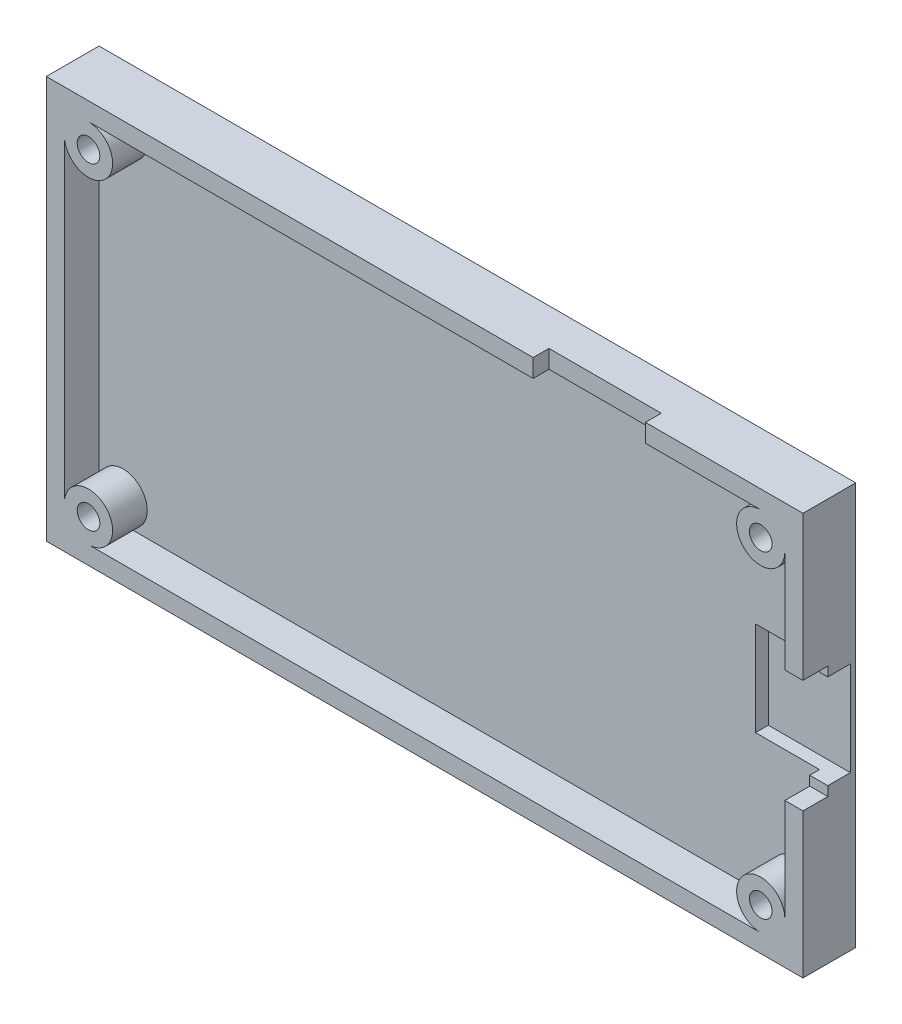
ISO-10303-21;
HEADER;
FILE_DESCRIPTION(('STEP AP214'),'2;1');
FILE_NAME('part.step','',(''),(''),'','','');
FILE_SCHEMA(('AUTOMOTIVE_DESIGN { 1 0 10303 214 1 1 1 1 }'));
ENDSEC;
DATA;
#1=APPLICATION_CONTEXT('core data for automotive mechanical design processes');
#2=APPLICATION_PROTOCOL_DEFINITION('international standard','automotive_design',2000,#1);
#3=PRODUCT_CONTEXT('',#1,'mechanical');
#4=PRODUCT('Part','Part','',(#3));
#5=PRODUCT_RELATED_PRODUCT_CATEGORY('part','',(#4));
#6=PRODUCT_DEFINITION_FORMATION('','',#4);
#7=PRODUCT_DEFINITION_CONTEXT('part definition',#1,'design');
#8=PRODUCT_DEFINITION('design','',#6,#7);
#9=PRODUCT_DEFINITION_SHAPE('','',#8);
#10=(LENGTH_UNIT() NAMED_UNIT(*) SI_UNIT(.MILLI.,.METRE.));
#11=(NAMED_UNIT(*) PLANE_ANGLE_UNIT() SI_UNIT($,.RADIAN.));
#12=(NAMED_UNIT(*) SI_UNIT($,.STERADIAN.) SOLID_ANGLE_UNIT());
#13=UNCERTAINTY_MEASURE_WITH_UNIT(LENGTH_MEASURE(1.E-05),#10,'distance_accuracy_value','');
#14=(GEOMETRIC_REPRESENTATION_CONTEXT(3) GLOBAL_UNCERTAINTY_ASSIGNED_CONTEXT((#13)) GLOBAL_UNIT_ASSIGNED_CONTEXT((#10,
#11,#12)) REPRESENTATION_CONTEXT('',''));
#15=CARTESIAN_POINT('',(0.,0.,0.));
#16=DIRECTION('',(0.,0.,1.));
#17=DIRECTION('',(1.,0.,0.));
#18=AXIS2_PLACEMENT_3D('',#15,#16,#17);
#19=CARTESIAN_POINT('',(0.,0.,7.));
#20=DIRECTION('',(0.,0.,-1.));
#21=DIRECTION('',(-1.,0.,0.));
#22=AXIS2_PLACEMENT_3D('',#19,#20,#21);
#23=PLANE('',#22);
#24=CARTESIAN_POINT('',(44.6,21.1,7.));
#25=DIRECTION('',(0.,0.,-1.));
#26=DIRECTION('',(-1.,0.,0.));
#27=AXIS2_PLACEMENT_3D('',#24,#25,#26);
#28=CIRCLE('',#27,1.5);
#29=CARTESIAN_POINT('',(43.1,21.1,7.));
#30=VERTEX_POINT('',#29);
#31=EDGE_CURVE('E434',#30,#30,#28,.T.);
#32=ORIENTED_EDGE('',*,*,#31,.T.);
#33=EDGE_LOOP('',(#32));
#34=FACE_BOUND('',#33,.T.);
#35=DIRECTION('',(-1.,0.,0.));
#36=VECTOR('',#35,1.);
#37=CARTESIAN_POINT('',(50.2,26.7,7.));
#38=LINE('',#37,#36);
#39=CARTESIAN_POINT('',(50.2,26.7,7.));
#40=VERTEX_POINT('',#39);
#41=CARTESIAN_POINT('',(29.3,26.7,7.));
#42=VERTEX_POINT('',#41);
#43=EDGE_CURVE('E227',#40,#42,#38,.T.);
#44=ORIENTED_EDGE('',*,*,#43,.T.);
#45=DIRECTION('',(0.,1.,0.));
#46=VECTOR('',#45,1.);
#47=CARTESIAN_POINT('',(29.3,28.7627397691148,7.));
#48=LINE('',#47,#46);
#49=CARTESIAN_POINT('',(29.3,24.3,7.));
#50=VERTEX_POINT('',#49);
#51=EDGE_CURVE('E214',#50,#42,#48,.T.);
#52=ORIENTED_EDGE('',*,*,#51,.F.);
#53=DIRECTION('',(-1.,0.,0.));
#54=VECTOR('',#53,1.);
#55=CARTESIAN_POINT('',(47.8,24.3,7.));
#56=LINE('',#55,#54);
#57=CARTESIAN_POINT('',(44.6,24.3,7.));
#58=VERTEX_POINT('',#57);
#59=EDGE_CURVE('E224',#58,#50,#56,.T.);
#60=ORIENTED_EDGE('',*,*,#59,.F.);
#61=CARTESIAN_POINT('',(44.6,21.1,7.));
#62=DIRECTION('',(0.,0.,-1.));
#63=DIRECTION('',(-1.,0.,0.));
#64=AXIS2_PLACEMENT_3D('',#61,#62,#63);
#65=CIRCLE('',#64,3.20000000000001);
#66=CARTESIAN_POINT('',(47.8,21.1,7.));
#67=VERTEX_POINT('',#66);
#68=EDGE_CURVE('E428',#67,#58,#65,.T.);
#69=ORIENTED_EDGE('',*,*,#68,.F.);
#70=DIRECTION('',(0.,1.,0.));
#71=VECTOR('',#70,1.);
#72=CARTESIAN_POINT('',(47.8,24.3,7.));
#73=LINE('',#72,#71);
#74=CARTESIAN_POINT('',(47.8,7.5,7.));
#75=VERTEX_POINT('',#74);
#76=EDGE_CURVE('E441',#75,#67,#73,.T.);
#77=ORIENTED_EDGE('',*,*,#76,.F.);
#78=DIRECTION('',(-1.,0.,0.));
#79=VECTOR('',#78,1.);
#80=CARTESIAN_POINT('',(51.4105747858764,7.50000000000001,7.));
#81=LINE('',#80,#79);
#82=CARTESIAN_POINT('',(50.2,7.50000000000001,7.));
#83=VERTEX_POINT('',#82);
#84=EDGE_CURVE('E373',#83,#75,#81,.T.);
#85=ORIENTED_EDGE('',*,*,#84,.F.);
#86=DIRECTION('',(0.,1.,0.));
#87=VECTOR('',#86,1.);
#88=CARTESIAN_POINT('',(50.2,26.7,7.));
#89=LINE('',#88,#87);
#90=EDGE_CURVE('E251',#83,#40,#89,.T.);
#91=ORIENTED_EDGE('',*,*,#90,.T.);
#92=EDGE_LOOP('',(#44,#52,#60,#69,#77,#85,#91));
#93=FACE_BOUND('',#92,.T.);
#94=ADVANCED_FACE('F39',(#34,#93),#23,.F.);
#95=CARTESIAN_POINT('',(47.8,24.3,7.));
#96=DIRECTION('',(-1.,0.,0.));
#97=DIRECTION('',(0.,-1.,0.));
#98=AXIS2_PLACEMENT_3D('',#95,#96,#97);
#99=PLANE('',#98);
#100=DIRECTION('',(0.,-1.,0.));
#101=VECTOR('',#100,1.);
#102=CARTESIAN_POINT('',(47.8,24.3,3.7));
#103=LINE('',#102,#101);
#104=CARTESIAN_POINT('',(47.8,-6.25,3.7));
#105=VERTEX_POINT('',#104);
#106=CARTESIAN_POINT('',(47.8,-7.5,3.7));
#107=VERTEX_POINT('',#106);
#108=EDGE_CURVE('E376',#105,#107,#103,.T.);
#109=ORIENTED_EDGE('',*,*,#108,.F.);
#110=DIRECTION('',(0.,0.,-1.));
#111=VECTOR('',#110,1.);
#112=CARTESIAN_POINT('',(47.8,-6.25,7.));
#113=LINE('',#112,#111);
#114=CARTESIAN_POINT('',(47.8,-6.25,2.4));
#115=VERTEX_POINT('',#114);
#116=EDGE_CURVE('E62',#105,#115,#113,.T.);
#117=ORIENTED_EDGE('',*,*,#116,.T.);
#118=DIRECTION('',(0.,-1.,0.));
#119=VECTOR('',#118,1.);
#120=CARTESIAN_POINT('',(47.8,24.3,2.4));
#121=LINE('',#120,#119);
#122=CARTESIAN_POINT('',(47.8,-21.1,2.4));
#123=VERTEX_POINT('',#122);
#124=EDGE_CURVE('E282',#115,#123,#121,.T.);
#125=ORIENTED_EDGE('',*,*,#124,.T.);
#126=DIRECTION('',(0.,0.,-1.));
#127=VECTOR('',#126,1.);
#128=CARTESIAN_POINT('',(47.8,-21.1,16.0509667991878));
#129=LINE('',#128,#127);
#130=CARTESIAN_POINT('',(47.8,-21.1,7.));
#131=VERTEX_POINT('',#130);
#132=EDGE_CURVE('E405',#131,#123,#129,.T.);
#133=ORIENTED_EDGE('',*,*,#132,.F.);
#134=CARTESIAN_POINT('',(47.8,-7.5,7.));
#135=VERTEX_POINT('',#134);
#136=EDGE_CURVE('E241',#131,#135,#73,.T.);
#137=ORIENTED_EDGE('',*,*,#136,.T.);
#138=DIRECTION('',(0.,0.,1.));
#139=VECTOR('',#138,1.);
#140=CARTESIAN_POINT('',(47.8,-7.49999999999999,7.));
#141=LINE('',#140,#139);
#142=EDGE_CURVE('E382',#107,#135,#141,.T.);
#143=ORIENTED_EDGE('',*,*,#142,.F.);
#144=EDGE_LOOP('',(#109,#117,#125,#133,#137,#143));
#145=FACE_BOUND('',#144,.T.);
#146=ADVANCED_FACE('F453',(#145),#99,.T.);
#147=CARTESIAN_POINT('',(0.,0.,3.7));
#148=DIRECTION('',(0.,0.,-1.));
#149=DIRECTION('',(-1.,0.,0.));
#150=AXIS2_PLACEMENT_3D('',#147,#148,#149);
#151=PLANE('',#150);
#152=DIRECTION('',(1.,0.,0.));
#153=VECTOR('',#152,1.);
#154=CARTESIAN_POINT('',(0.,-6.25000000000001,3.7));
#155=LINE('',#154,#153);
#156=CARTESIAN_POINT('',(50.2,-6.25,3.7));
#157=VERTEX_POINT('',#156);
#158=EDGE_CURVE('E308',#105,#157,#155,.T.);
#159=ORIENTED_EDGE('',*,*,#158,.F.);
#160=ORIENTED_EDGE('',*,*,#108,.T.);
#161=DIRECTION('',(1.,0.,0.));
#162=VECTOR('',#161,1.);
#163=CARTESIAN_POINT('',(51.4105747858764,-7.49999999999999,3.7));
#164=LINE('',#163,#162);
#165=CARTESIAN_POINT('',(50.2,-7.49999999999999,3.7));
#166=VERTEX_POINT('',#165);
#167=EDGE_CURVE('E369',#107,#166,#164,.T.);
#168=ORIENTED_EDGE('',*,*,#167,.T.);
#169=DIRECTION('',(0.,-1.,0.));
#170=VECTOR('',#169,1.);
#171=CARTESIAN_POINT('',(50.2,26.7,3.7));
#172=LINE('',#171,#170);
#173=EDGE_CURVE('E298',#157,#166,#172,.T.);
#174=ORIENTED_EDGE('',*,*,#173,.F.);
#175=EDGE_LOOP('',(#159,#160,#168,#174));
#176=FACE_BOUND('',#175,.T.);
#177=ADVANCED_FACE('F467',(#176),#151,.F.);
#178=CARTESIAN_POINT('',(47.8,-24.3,7.));
#179=DIRECTION('',(0.,1.,0.));
#180=DIRECTION('',(-1.,0.,0.));
#181=AXIS2_PLACEMENT_3D('',#178,#179,#180);
#182=PLANE('',#181);
#183=DIRECTION('',(-1.,0.,0.));
#184=VECTOR('',#183,1.);
#185=CARTESIAN_POINT('',(47.8,-24.3,2.4));
#186=LINE('',#185,#184);
#187=CARTESIAN_POINT('',(44.6,-24.3,2.4));
#188=VERTEX_POINT('',#187);
#189=CARTESIAN_POINT('',(-44.5999999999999,-24.3,2.4));
#190=VERTEX_POINT('',#189);
#191=EDGE_CURVE('E279',#188,#190,#186,.T.);
#192=ORIENTED_EDGE('',*,*,#191,.T.);
#193=DIRECTION('',(0.,0.,-1.));
#194=VECTOR('',#193,1.);
#195=CARTESIAN_POINT('',(-44.6,-24.3,16.0509667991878));
#196=LINE('',#195,#194);
#197=CARTESIAN_POINT('',(-44.6,-24.3,7.));
#198=VERTEX_POINT('',#197);
#199=EDGE_CURVE('E391',#198,#190,#196,.T.);
#200=ORIENTED_EDGE('',*,*,#199,.F.);
#201=DIRECTION('',(1.,0.,0.));
#202=VECTOR('',#201,1.);
#203=CARTESIAN_POINT('',(47.8,-24.3,7.));
#204=LINE('',#203,#202);
#205=CARTESIAN_POINT('',(44.6,-24.3,7.));
#206=VERTEX_POINT('',#205);
#207=EDGE_CURVE('E440',#198,#206,#204,.T.);
#208=ORIENTED_EDGE('',*,*,#207,.T.);
#209=DIRECTION('',(0.,0.,-1.));
#210=VECTOR('',#209,1.);
#211=CARTESIAN_POINT('',(44.6,-24.3,16.0509667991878));
#212=LINE('',#211,#210);
#213=EDGE_CURVE('E404',#206,#188,#212,.T.);
#214=ORIENTED_EDGE('',*,*,#213,.T.);
#215=EDGE_LOOP('',(#192,#200,#208,#214));
#216=FACE_BOUND('',#215,.T.);
#217=ADVANCED_FACE('F477',(#216),#182,.T.);
#218=DIRECTION('',(0.,0.,-1.));
#219=VECTOR('',#218,1.);
#220=CARTESIAN_POINT('',(47.8,6.25,7.));
#221=LINE('',#220,#219);
#222=CARTESIAN_POINT('',(47.8,6.25,3.7));
#223=VERTEX_POINT('',#222);
#224=CARTESIAN_POINT('',(47.8,6.25,2.4));
#225=VERTEX_POINT('',#224);
#226=EDGE_CURVE('E366',#223,#225,#221,.T.);
#227=ORIENTED_EDGE('',*,*,#226,.F.);
#228=CARTESIAN_POINT('',(47.8,7.5,3.7));
#229=VERTEX_POINT('',#228);
#230=EDGE_CURVE('E379',#229,#223,#103,.T.);
#231=ORIENTED_EDGE('',*,*,#230,.F.);
#232=DIRECTION('',(0.,0.,-1.));
#233=VECTOR('',#232,1.);
#234=CARTESIAN_POINT('',(47.8,7.50000000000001,7.));
#235=LINE('',#234,#233);
#236=EDGE_CURVE('E384',#75,#229,#235,.T.);
#237=ORIENTED_EDGE('',*,*,#236,.F.);
#238=ORIENTED_EDGE('',*,*,#76,.T.);
#239=DIRECTION('',(0.,0.,-1.));
#240=VECTOR('',#239,1.);
#241=CARTESIAN_POINT('',(47.8,21.1,16.0509667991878));
#242=LINE('',#241,#240);
#243=CARTESIAN_POINT('',(47.8,21.1,2.4));
#244=VERTEX_POINT('',#243);
#245=EDGE_CURVE('E432',#67,#244,#242,.T.);
#246=ORIENTED_EDGE('',*,*,#245,.T.);
#247=EDGE_CURVE('E283',#244,#225,#121,.T.);
#248=ORIENTED_EDGE('',*,*,#247,.T.);
#249=EDGE_LOOP('',(#227,#231,#237,#238,#246,#248));
#250=FACE_BOUND('',#249,.T.);
#251=ADVANCED_FACE('F523',(#250),#99,.T.);
#252=CARTESIAN_POINT('',(-47.8,24.3,7.));
#253=DIRECTION('',(1.,0.,0.));
#254=DIRECTION('',(0.,0.,-1.));
#255=AXIS2_PLACEMENT_3D('',#252,#253,#254);
#256=PLANE('',#255);
#257=DIRECTION('',(0.,0.,-1.));
#258=VECTOR('',#257,1.);
#259=CARTESIAN_POINT('',(-47.8,-21.1,16.0509667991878));
#260=LINE('',#259,#258);
#261=CARTESIAN_POINT('',(-47.8,-21.1,7.));
#262=VERTEX_POINT('',#261);
#263=CARTESIAN_POINT('',(-47.8,-21.1,2.4));
#264=VERTEX_POINT('',#263);
#265=EDGE_CURVE('E390',#262,#264,#260,.T.);
#266=ORIENTED_EDGE('',*,*,#265,.T.);
#267=DIRECTION('',(0.,-1.,0.));
#268=VECTOR('',#267,1.);
#269=CARTESIAN_POINT('',(-47.8,24.3,2.4));
#270=LINE('',#269,#268);
#271=CARTESIAN_POINT('',(-47.8,21.1,2.4));
#272=VERTEX_POINT('',#271);
#273=EDGE_CURVE('E276',#272,#264,#270,.T.);
#274=ORIENTED_EDGE('',*,*,#273,.F.);
#275=DIRECTION('',(0.,0.,-1.));
#276=VECTOR('',#275,1.);
#277=CARTESIAN_POINT('',(-47.8,21.1,16.0509667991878));
#278=LINE('',#277,#276);
#279=CARTESIAN_POINT('',(-47.8,21.1,7.));
#280=VERTEX_POINT('',#279);
#281=EDGE_CURVE('E419',#280,#272,#278,.T.);
#282=ORIENTED_EDGE('',*,*,#281,.F.);
#283=DIRECTION('',(0.,-1.,0.));
#284=VECTOR('',#283,1.);
#285=CARTESIAN_POINT('',(-47.8,24.3,7.));
#286=LINE('',#285,#284);
#287=EDGE_CURVE('E439',#280,#262,#286,.T.);
#288=ORIENTED_EDGE('',*,*,#287,.T.);
#289=EDGE_LOOP('',(#266,#274,#282,#288));
#290=FACE_BOUND('',#289,.T.);
#291=ADVANCED_FACE('F486',(#290),#256,.T.);
#292=CARTESIAN_POINT('',(47.8,24.3,7.));
#293=DIRECTION('',(0.,-1.,0.));
#294=DIRECTION('',(0.,0.,-1.));
#295=AXIS2_PLACEMENT_3D('',#292,#293,#294);
#296=PLANE('',#295);
#297=DIRECTION('',(0.,0.,1.));
#298=VECTOR('',#297,1.);
#299=CARTESIAN_POINT('',(29.3,24.3,7.));
#300=LINE('',#299,#298);
#301=CARTESIAN_POINT('',(29.3,24.3,4.9));
#302=VERTEX_POINT('',#301);
#303=EDGE_CURVE('E211',#302,#50,#300,.T.);
#304=ORIENTED_EDGE('',*,*,#303,.F.);
#305=DIRECTION('',(-1.,0.,0.));
#306=VECTOR('',#305,1.);
#307=CARTESIAN_POINT('',(47.8,24.3,4.9));
#308=LINE('',#307,#306);
#309=CARTESIAN_POINT('',(14.4,24.3,4.9));
#310=VERTEX_POINT('',#309);
#311=EDGE_CURVE('E340',#302,#310,#308,.T.);
#312=ORIENTED_EDGE('',*,*,#311,.T.);
#313=DIRECTION('',(0.,0.,-1.));
#314=VECTOR('',#313,1.);
#315=CARTESIAN_POINT('',(14.4,24.3,7.));
#316=LINE('',#315,#314);
#317=CARTESIAN_POINT('',(14.4,24.3,7.));
#318=VERTEX_POINT('',#317);
#319=EDGE_CURVE('E219',#318,#310,#316,.T.);
#320=ORIENTED_EDGE('',*,*,#319,.F.);
#321=CARTESIAN_POINT('',(-44.5999999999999,24.3,7.));
#322=VERTEX_POINT('',#321);
#323=EDGE_CURVE('E236',#318,#322,#56,.T.);
#324=ORIENTED_EDGE('',*,*,#323,.T.);
#325=DIRECTION('',(0.,0.,-1.));
#326=VECTOR('',#325,1.);
#327=CARTESIAN_POINT('',(-44.6,24.3,16.0509667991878));
#328=LINE('',#327,#326);
#329=CARTESIAN_POINT('',(-44.5999999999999,24.3,2.4));
#330=VERTEX_POINT('',#329);
#331=EDGE_CURVE('E418',#322,#330,#328,.T.);
#332=ORIENTED_EDGE('',*,*,#331,.T.);
#333=DIRECTION('',(-1.,0.,0.));
#334=VECTOR('',#333,1.);
#335=CARTESIAN_POINT('',(47.8,24.3,2.4));
#336=LINE('',#335,#334);
#337=CARTESIAN_POINT('',(44.6,24.3,2.4));
#338=VERTEX_POINT('',#337);
#339=EDGE_CURVE('E273',#338,#330,#336,.T.);
#340=ORIENTED_EDGE('',*,*,#339,.F.);
#341=DIRECTION('',(0.,0.,-1.));
#342=VECTOR('',#341,1.);
#343=CARTESIAN_POINT('',(44.6,24.3,16.0509667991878));
#344=LINE('',#343,#342);
#345=EDGE_CURVE('E233',#58,#338,#344,.T.);
#346=ORIENTED_EDGE('',*,*,#345,.F.);
#347=ORIENTED_EDGE('',*,*,#59,.T.);
#348=EDGE_LOOP('',(#304,#312,#320,#324,#332,#340,#346,#347));
#349=FACE_BOUND('',#348,.T.);
#350=ADVANCED_FACE('F230',(#349),#296,.T.);
#351=CARTESIAN_POINT('',(0.,0.,2.4));
#352=DIRECTION('',(0.,0.,1.));
#353=DIRECTION('',(1.,0.,0.));
#354=AXIS2_PLACEMENT_3D('',#351,#352,#353);
#355=PLANE('',#354);
#356=DIRECTION('',(-1.,0.,0.));
#357=VECTOR('',#356,1.);
#358=CARTESIAN_POINT('',(0.,6.25,2.4));
#359=LINE('',#358,#357);
#360=CARTESIAN_POINT('',(39.3,6.25,2.4));
#361=VERTEX_POINT('',#360);
#362=EDGE_CURVE('E364',#225,#361,#359,.T.);
#363=ORIENTED_EDGE('',*,*,#362,.F.);
#364=ORIENTED_EDGE('',*,*,#247,.F.);
#365=CARTESIAN_POINT('',(44.6,21.1,2.4));
#366=DIRECTION('',(0.,0.,1.));
#367=DIRECTION('',(-1.,0.,0.));
#368=AXIS2_PLACEMENT_3D('',#365,#366,#367);
#369=CIRCLE('',#368,3.20000000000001);
#370=EDGE_CURVE('E429',#338,#244,#369,.T.);
#371=ORIENTED_EDGE('',*,*,#370,.F.);
#372=ORIENTED_EDGE('',*,*,#339,.T.);
#373=CARTESIAN_POINT('',(-44.6,21.1,2.4));
#374=DIRECTION('',(0.,0.,1.));
#375=DIRECTION('',(1.,0.,0.));
#376=AXIS2_PLACEMENT_3D('',#373,#374,#375);
#377=CIRCLE('',#376,3.20000000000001);
#378=EDGE_CURVE('E415',#272,#330,#377,.T.);
#379=ORIENTED_EDGE('',*,*,#378,.F.);
#380=ORIENTED_EDGE('',*,*,#273,.T.);
#381=CARTESIAN_POINT('',(-44.6,-21.1,2.4));
#382=DIRECTION('',(0.,0.,1.));
#383=DIRECTION('',(-1.,0.,0.));
#384=AXIS2_PLACEMENT_3D('',#381,#382,#383);
#385=CIRCLE('',#384,3.20000000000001);
#386=EDGE_CURVE('E387',#190,#264,#385,.T.);
#387=ORIENTED_EDGE('',*,*,#386,.F.);
#388=ORIENTED_EDGE('',*,*,#191,.F.);
#389=CARTESIAN_POINT('',(44.6,-21.1,2.4));
#390=DIRECTION('',(0.,0.,1.));
#391=DIRECTION('',(1.,0.,0.));
#392=AXIS2_PLACEMENT_3D('',#389,#390,#391);
#393=CIRCLE('',#392,3.20000000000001);
#394=EDGE_CURVE('E401',#123,#188,#393,.T.);
#395=ORIENTED_EDGE('',*,*,#394,.F.);
#396=ORIENTED_EDGE('',*,*,#124,.F.);
#397=DIRECTION('',(-1.,0.,0.));
#398=VECTOR('',#397,1.);
#399=CARTESIAN_POINT('',(0.,-6.25000000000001,2.4));
#400=LINE('',#399,#398);
#401=CARTESIAN_POINT('',(39.3,-6.25,2.4));
#402=VERTEX_POINT('',#401);
#403=EDGE_CURVE('E357',#115,#402,#400,.T.);
#404=ORIENTED_EDGE('',*,*,#403,.T.);
#405=DIRECTION('',(0.,-1.,0.));
#406=VECTOR('',#405,1.);
#407=CARTESIAN_POINT('',(39.3,0.,2.4));
#408=LINE('',#407,#406);
#409=EDGE_CURVE('E315',#361,#402,#408,.T.);
#410=ORIENTED_EDGE('',*,*,#409,.F.);
#411=EDGE_LOOP('',(#363,#364,#371,#372,#379,#380,#387,#388,#395,#396,#404,#410));
#412=FACE_BOUND('',#411,.T.);
#413=ADVANCED_FACE('F472',(#412),#355,.T.);
#414=ORIENTED_EDGE('',*,*,#323,.F.);
#415=DIRECTION('',(0.,-1.,0.));
#416=VECTOR('',#415,1.);
#417=CARTESIAN_POINT('',(14.4,28.7627397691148,7.));
#418=LINE('',#417,#416);
#419=CARTESIAN_POINT('',(14.4,26.7,7.));
#420=VERTEX_POINT('',#419);
#421=EDGE_CURVE('E228',#420,#318,#418,.T.);
#422=ORIENTED_EDGE('',*,*,#421,.F.);
#423=CARTESIAN_POINT('',(-50.2,26.7,7.));
#424=VERTEX_POINT('',#423);
#425=EDGE_CURVE('E255',#420,#424,#38,.T.);
#426=ORIENTED_EDGE('',*,*,#425,.T.);
#427=DIRECTION('',(0.,-1.,0.));
#428=VECTOR('',#427,1.);
#429=CARTESIAN_POINT('',(-50.2,26.7,7.));
#430=LINE('',#429,#428);
#431=CARTESIAN_POINT('',(-50.2,-26.7,7.));
#432=VERTEX_POINT('',#431);
#433=EDGE_CURVE('E245',#424,#432,#430,.T.);
#434=ORIENTED_EDGE('',*,*,#433,.T.);
#435=DIRECTION('',(1.,0.,0.));
#436=VECTOR('',#435,1.);
#437=CARTESIAN_POINT('',(50.2,-26.7,7.));
#438=LINE('',#437,#436);
#439=CARTESIAN_POINT('',(50.2,-26.7,7.));
#440=VERTEX_POINT('',#439);
#441=EDGE_CURVE('E248',#432,#440,#438,.T.);
#442=ORIENTED_EDGE('',*,*,#441,.T.);
#443=CARTESIAN_POINT('',(50.2,-7.49999999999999,7.));
#444=VERTEX_POINT('',#443);
#445=EDGE_CURVE('E252',#440,#444,#89,.T.);
#446=ORIENTED_EDGE('',*,*,#445,.T.);
#447=DIRECTION('',(1.,0.,0.));
#448=VECTOR('',#447,1.);
#449=CARTESIAN_POINT('',(51.4105747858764,-7.49999999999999,7.));
#450=LINE('',#449,#448);
#451=EDGE_CURVE('E368',#135,#444,#450,.T.);
#452=ORIENTED_EDGE('',*,*,#451,.F.);
#453=ORIENTED_EDGE('',*,*,#136,.F.);
#454=CARTESIAN_POINT('',(44.6,-21.1,7.));
#455=DIRECTION('',(0.,0.,-1.));
#456=DIRECTION('',(-1.,0.,0.));
#457=AXIS2_PLACEMENT_3D('',#454,#455,#456);
#458=CIRCLE('',#457,3.20000000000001);
#459=EDGE_CURVE('E400',#206,#131,#458,.T.);
#460=ORIENTED_EDGE('',*,*,#459,.F.);
#461=ORIENTED_EDGE('',*,*,#207,.F.);
#462=CARTESIAN_POINT('',(-44.6,-21.1,7.));
#463=DIRECTION('',(0.,0.,-1.));
#464=DIRECTION('',(-1.,0.,0.));
#465=AXIS2_PLACEMENT_3D('',#462,#463,#464);
#466=CIRCLE('',#465,3.20000000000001);
#467=EDGE_CURVE('E386',#262,#198,#466,.T.);
#468=ORIENTED_EDGE('',*,*,#467,.F.);
#469=ORIENTED_EDGE('',*,*,#287,.F.);
#470=CARTESIAN_POINT('',(-44.6,21.1,7.));
#471=DIRECTION('',(0.,0.,-1.));
#472=DIRECTION('',(-1.,0.,0.));
#473=AXIS2_PLACEMENT_3D('',#470,#471,#472);
#474=CIRCLE('',#473,3.20000000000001);
#475=EDGE_CURVE('E414',#322,#280,#474,.T.);
#476=ORIENTED_EDGE('',*,*,#475,.F.);
#477=EDGE_LOOP('',(#414,#422,#426,#434,#442,#446,#452,#453,#460,#461,#468,#469,#476));
#478=FACE_BOUND('',#477,.T.);
#479=CARTESIAN_POINT('',(-44.6,21.1,7.));
#480=DIRECTION('',(0.,0.,-1.));
#481=DIRECTION('',(-1.,0.,0.));
#482=AXIS2_PLACEMENT_3D('',#479,#480,#481);
#483=CIRCLE('',#482,1.5);
#484=CARTESIAN_POINT('',(-46.1,21.1,7.));
#485=VERTEX_POINT('',#484);
#486=EDGE_CURVE('E421',#485,#485,#483,.T.);
#487=ORIENTED_EDGE('',*,*,#486,.T.);
#488=EDGE_LOOP('',(#487));
#489=FACE_BOUND('',#488,.T.);
#490=CARTESIAN_POINT('',(44.6,-21.1,7.));
#491=DIRECTION('',(0.,0.,-1.));
#492=DIRECTION('',(-1.,0.,0.));
#493=AXIS2_PLACEMENT_3D('',#490,#491,#492);
#494=CIRCLE('',#493,1.5);
#495=CARTESIAN_POINT('',(43.1,-21.1,7.));
#496=VERTEX_POINT('',#495);
#497=EDGE_CURVE('E407',#496,#496,#494,.T.);
#498=ORIENTED_EDGE('',*,*,#497,.T.);
#499=EDGE_LOOP('',(#498));
#500=FACE_BOUND('',#499,.T.);
#501=CARTESIAN_POINT('',(-44.6,-21.1,7.));
#502=DIRECTION('',(0.,0.,-1.));
#503=DIRECTION('',(-1.,0.,0.));
#504=AXIS2_PLACEMENT_3D('',#501,#502,#503);
#505=CIRCLE('',#504,1.5);
#506=CARTESIAN_POINT('',(-46.1,-21.1,7.));
#507=VERTEX_POINT('',#506);
#508=EDGE_CURVE('E393',#507,#507,#505,.T.);
#509=ORIENTED_EDGE('',*,*,#508,.T.);
#510=EDGE_LOOP('',(#509));
#511=FACE_BOUND('',#510,.T.);
#512=ADVANCED_FACE('F333',(#478,#489,#500,#511),#23,.F.);
#513=CARTESIAN_POINT('',(-50.2,26.7,7.));
#514=DIRECTION('',(1.,0.,0.));
#515=DIRECTION('',(0.,0.,-1.));
#516=AXIS2_PLACEMENT_3D('',#513,#514,#515);
#517=PLANE('',#516);
#518=DIRECTION('',(0.,-1.,0.));
#519=VECTOR('',#518,1.);
#520=CARTESIAN_POINT('',(-50.2,26.7,0.));
#521=LINE('',#520,#519);
#522=CARTESIAN_POINT('',(-50.2,26.7,0.));
#523=VERTEX_POINT('',#522);
#524=CARTESIAN_POINT('',(-50.2,-26.7,0.));
#525=VERTEX_POINT('',#524);
#526=EDGE_CURVE('E235',#523,#525,#521,.T.);
#527=ORIENTED_EDGE('',*,*,#526,.T.);
#528=DIRECTION('',(0.,0.,-1.));
#529=VECTOR('',#528,1.);
#530=CARTESIAN_POINT('',(-50.2,-26.7,7.));
#531=LINE('',#530,#529);
#532=EDGE_CURVE('E270',#432,#525,#531,.T.);
#533=ORIENTED_EDGE('',*,*,#532,.F.);
#534=ORIENTED_EDGE('',*,*,#433,.F.);
#535=DIRECTION('',(0.,0.,-1.));
#536=VECTOR('',#535,1.);
#537=CARTESIAN_POINT('',(-50.2,26.7,7.));
#538=LINE('',#537,#536);
#539=EDGE_CURVE('E256',#424,#523,#538,.T.);
#540=ORIENTED_EDGE('',*,*,#539,.T.);
#541=EDGE_LOOP('',(#527,#533,#534,#540));
#542=FACE_BOUND('',#541,.T.);
#543=ADVANCED_FACE('F503',(#542),#517,.F.);
#544=CARTESIAN_POINT('',(50.2,-26.7,7.));
#545=DIRECTION('',(0.,1.,0.));
#546=DIRECTION('',(0.,0.,1.));
#547=AXIS2_PLACEMENT_3D('',#544,#545,#546);
#548=PLANE('',#547);
#549=DIRECTION('',(1.,0.,0.));
#550=VECTOR('',#549,1.);
#551=CARTESIAN_POINT('',(50.2,-26.7,0.));
#552=LINE('',#551,#550);
#553=CARTESIAN_POINT('',(50.2,-26.7,0.));
#554=VERTEX_POINT('',#553);
#555=EDGE_CURVE('E239',#525,#554,#552,.T.);
#556=ORIENTED_EDGE('',*,*,#555,.T.);
#557=DIRECTION('',(0.,0.,-1.));
#558=VECTOR('',#557,1.);
#559=CARTESIAN_POINT('',(50.2,-26.7,7.));
#560=LINE('',#559,#558);
#561=EDGE_CURVE('E267',#440,#554,#560,.T.);
#562=ORIENTED_EDGE('',*,*,#561,.F.);
#563=ORIENTED_EDGE('',*,*,#441,.F.);
#564=ORIENTED_EDGE('',*,*,#532,.T.);
#565=EDGE_LOOP('',(#556,#562,#563,#564));
#566=FACE_BOUND('',#565,.T.);
#567=ADVANCED_FACE('F507',(#566),#548,.F.);
#568=CARTESIAN_POINT('',(50.2,26.7,7.));
#569=DIRECTION('',(-1.,0.,0.));
#570=DIRECTION('',(0.,0.,1.));
#571=AXIS2_PLACEMENT_3D('',#568,#569,#570);
#572=PLANE('',#571);
#573=CARTESIAN_POINT('',(50.2,7.50000000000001,3.7));
#574=VERTEX_POINT('',#573);
#575=CARTESIAN_POINT('',(50.2,6.25,3.7));
#576=VERTEX_POINT('',#575);
#577=EDGE_CURVE('E299',#574,#576,#172,.T.);
#578=ORIENTED_EDGE('',*,*,#577,.T.);
#579=DIRECTION('',(0.,0.,-1.));
#580=VECTOR('',#579,1.);
#581=CARTESIAN_POINT('',(50.2,6.25,7.));
#582=LINE('',#581,#580);
#583=CARTESIAN_POINT('',(50.2,6.25,0.7));
#584=VERTEX_POINT('',#583);
#585=EDGE_CURVE('E361',#576,#584,#582,.T.);
#586=ORIENTED_EDGE('',*,*,#585,.T.);
#587=DIRECTION('',(0.,1.,0.));
#588=VECTOR('',#587,1.);
#589=CARTESIAN_POINT('',(50.2,26.7,0.7));
#590=LINE('',#589,#588);
#591=CARTESIAN_POINT('',(50.2,-6.25,0.7));
#592=VERTEX_POINT('',#591);
#593=EDGE_CURVE('E313',#592,#584,#590,.T.);
#594=ORIENTED_EDGE('',*,*,#593,.F.);
#595=DIRECTION('',(0.,0.,-1.));
#596=VECTOR('',#595,1.);
#597=CARTESIAN_POINT('',(50.2,-6.25,7.));
#598=LINE('',#597,#596);
#599=EDGE_CURVE('E353',#157,#592,#598,.T.);
#600=ORIENTED_EDGE('',*,*,#599,.F.);
#601=ORIENTED_EDGE('',*,*,#173,.T.);
#602=DIRECTION('',(0.,0.,1.));
#603=VECTOR('',#602,1.);
#604=CARTESIAN_POINT('',(50.2,-7.49999999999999,7.));
#605=LINE('',#604,#603);
#606=EDGE_CURVE('E302',#166,#444,#605,.T.);
#607=ORIENTED_EDGE('',*,*,#606,.T.);
#608=ORIENTED_EDGE('',*,*,#445,.F.);
#609=ORIENTED_EDGE('',*,*,#561,.T.);
#610=DIRECTION('',(0.,1.,0.));
#611=VECTOR('',#610,1.);
#612=CARTESIAN_POINT('',(50.2,26.7,0.));
#613=LINE('',#612,#611);
#614=CARTESIAN_POINT('',(50.2,26.7,0.));
#615=VERTEX_POINT('',#614);
#616=EDGE_CURVE('E259',#554,#615,#613,.T.);
#617=ORIENTED_EDGE('',*,*,#616,.T.);
#618=DIRECTION('',(0.,0.,-1.));
#619=VECTOR('',#618,1.);
#620=CARTESIAN_POINT('',(50.2,26.7,7.));
#621=LINE('',#620,#619);
#622=EDGE_CURVE('E264',#40,#615,#621,.T.);
#623=ORIENTED_EDGE('',*,*,#622,.F.);
#624=ORIENTED_EDGE('',*,*,#90,.F.);
#625=DIRECTION('',(0.,0.,-1.));
#626=VECTOR('',#625,1.);
#627=CARTESIAN_POINT('',(50.2,7.50000000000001,7.));
#628=LINE('',#627,#626);
#629=EDGE_CURVE('E305',#83,#574,#628,.T.);
#630=ORIENTED_EDGE('',*,*,#629,.T.);
#631=EDGE_LOOP('',(#578,#586,#594,#600,#601,#607,#608,#609,#617,#623,#624,#630));
#632=FACE_BOUND('',#631,.T.);
#633=ADVANCED_FACE('F462',(#632),#572,.F.);
#634=CARTESIAN_POINT('',(50.2,26.7,7.));
#635=DIRECTION('',(0.,-1.,0.));
#636=DIRECTION('',(0.,0.,-1.));
#637=AXIS2_PLACEMENT_3D('',#634,#635,#636);
#638=PLANE('',#637);
#639=DIRECTION('',(-1.,0.,0.));
#640=VECTOR('',#639,1.);
#641=CARTESIAN_POINT('',(50.2,26.7,4.9));
#642=LINE('',#641,#640);
#643=CARTESIAN_POINT('',(29.3,26.7,4.9));
#644=VERTEX_POINT('',#643);
#645=CARTESIAN_POINT('',(14.4,26.7,4.9));
#646=VERTEX_POINT('',#645);
#647=EDGE_CURVE('E317',#644,#646,#642,.T.);
#648=ORIENTED_EDGE('',*,*,#647,.F.);
#649=DIRECTION('',(0.,0.,1.));
#650=VECTOR('',#649,1.);
#651=CARTESIAN_POINT('',(29.3,26.7,7.));
#652=LINE('',#651,#650);
#653=EDGE_CURVE('E11',#644,#42,#652,.T.);
#654=ORIENTED_EDGE('',*,*,#653,.T.);
#655=ORIENTED_EDGE('',*,*,#43,.F.);
#656=ORIENTED_EDGE('',*,*,#622,.T.);
#657=DIRECTION('',(-1.,0.,0.));
#658=VECTOR('',#657,1.);
#659=CARTESIAN_POINT('',(50.2,26.7,0.));
#660=LINE('',#659,#658);
#661=EDGE_CURVE('E249',#615,#523,#660,.T.);
#662=ORIENTED_EDGE('',*,*,#661,.T.);
#663=ORIENTED_EDGE('',*,*,#539,.F.);
#664=ORIENTED_EDGE('',*,*,#425,.F.);
#665=DIRECTION('',(0.,0.,-1.));
#666=VECTOR('',#665,1.);
#667=CARTESIAN_POINT('',(14.4,26.7,7.));
#668=LINE('',#667,#666);
#669=EDGE_CURVE('E47',#420,#646,#668,.T.);
#670=ORIENTED_EDGE('',*,*,#669,.T.);
#671=EDGE_LOOP('',(#648,#654,#655,#656,#662,#663,#664,#670));
#672=FACE_BOUND('',#671,.T.);
#673=ADVANCED_FACE('F322',(#672),#638,.F.);
#674=CARTESIAN_POINT('',(0.,0.,0.));
#675=DIRECTION('',(0.,0.,1.));
#676=DIRECTION('',(1.,0.,0.));
#677=AXIS2_PLACEMENT_3D('',#674,#675,#676);
#678=PLANE('',#677);
#679=ORIENTED_EDGE('',*,*,#526,.F.);
#680=ORIENTED_EDGE('',*,*,#661,.F.);
#681=ORIENTED_EDGE('',*,*,#616,.F.);
#682=ORIENTED_EDGE('',*,*,#555,.F.);
#683=EDGE_LOOP('',(#679,#680,#681,#682));
#684=FACE_BOUND('',#683,.T.);
#685=ADVANCED_FACE('F41',(#684),#678,.F.);
#686=CARTESIAN_POINT('',(44.6,21.1,16.0509667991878));
#687=DIRECTION('',(0.,0.,-1.));
#688=DIRECTION('',(-1.,0.,0.));
#689=AXIS2_PLACEMENT_3D('',#686,#687,#688);
#690=CYLINDRICAL_SURFACE('',#689,3.20000000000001);
#691=ORIENTED_EDGE('',*,*,#245,.F.);
#692=ORIENTED_EDGE('',*,*,#68,.T.);
#693=ORIENTED_EDGE('',*,*,#345,.T.);
#694=ORIENTED_EDGE('',*,*,#370,.T.);
#695=EDGE_LOOP('',(#691,#692,#693,#694));
#696=FACE_BOUND('',#695,.T.);
#697=ADVANCED_FACE('F492',(#696),#690,.T.);
#698=CARTESIAN_POINT('',(44.6,21.1,16.0509667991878));
#699=DIRECTION('',(0.,0.,-1.));
#700=DIRECTION('',(-1.,0.,0.));
#701=AXIS2_PLACEMENT_3D('',#698,#699,#700);
#702=CYLINDRICAL_SURFACE('',#701,1.5);
#703=ORIENTED_EDGE('',*,*,#31,.F.);
#704=EDGE_LOOP('',(#703));
#705=FACE_BOUND('',#704,.T.);
#706=CARTESIAN_POINT('',(44.6,21.1,2.4));
#707=DIRECTION('',(0.,0.,1.));
#708=DIRECTION('',(1.,0.,0.));
#709=AXIS2_PLACEMENT_3D('',#706,#707,#708);
#710=CIRCLE('',#709,1.5);
#711=CARTESIAN_POINT('',(46.1,21.1,2.4));
#712=VERTEX_POINT('',#711);
#713=EDGE_CURVE('E286',#712,#712,#710,.F.);
#714=ORIENTED_EDGE('',*,*,#713,.T.);
#715=EDGE_LOOP('',(#714));
#716=FACE_BOUND('',#715,.T.);
#717=ADVANCED_FACE('F542',(#705,#716),#702,.F.);
#718=ORIENTED_EDGE('',*,*,#713,.F.);
#719=EDGE_LOOP('',(#718));
#720=FACE_BOUND('',#719,.T.);
#721=ADVANCED_FACE('F531',(#720),#355,.T.);
#722=CARTESIAN_POINT('',(-44.6,21.1,16.0509667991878));
#723=DIRECTION('',(0.,0.,-1.));
#724=DIRECTION('',(-1.,0.,0.));
#725=AXIS2_PLACEMENT_3D('',#722,#723,#724);
#726=CYLINDRICAL_SURFACE('',#725,3.20000000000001);
#727=ORIENTED_EDGE('',*,*,#331,.F.);
#728=ORIENTED_EDGE('',*,*,#475,.T.);
#729=ORIENTED_EDGE('',*,*,#281,.T.);
#730=ORIENTED_EDGE('',*,*,#378,.T.);
#731=EDGE_LOOP('',(#727,#728,#729,#730));
#732=FACE_BOUND('',#731,.T.);
#733=ADVANCED_FACE('F488',(#732),#726,.T.);
#734=CARTESIAN_POINT('',(-44.6,21.1,16.0509667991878));
#735=DIRECTION('',(0.,0.,-1.));
#736=DIRECTION('',(-1.,0.,0.));
#737=AXIS2_PLACEMENT_3D('',#734,#735,#736);
#738=CYLINDRICAL_SURFACE('',#737,1.5);
#739=ORIENTED_EDGE('',*,*,#486,.F.);
#740=EDGE_LOOP('',(#739));
#741=FACE_BOUND('',#740,.T.);
#742=CARTESIAN_POINT('',(-44.6,21.1,2.4));
#743=DIRECTION('',(0.,0.,1.));
#744=DIRECTION('',(1.,0.,0.));
#745=AXIS2_PLACEMENT_3D('',#742,#743,#744);
#746=CIRCLE('',#745,1.5);
#747=CARTESIAN_POINT('',(-43.1,21.1,2.4));
#748=VERTEX_POINT('',#747);
#749=EDGE_CURVE('E289',#748,#748,#746,.F.);
#750=ORIENTED_EDGE('',*,*,#749,.T.);
#751=EDGE_LOOP('',(#750));
#752=FACE_BOUND('',#751,.T.);
#753=ADVANCED_FACE('F549',(#741,#752),#738,.F.);
#754=ORIENTED_EDGE('',*,*,#749,.F.);
#755=EDGE_LOOP('',(#754));
#756=FACE_BOUND('',#755,.T.);
#757=ADVANCED_FACE('F544',(#756),#355,.T.);
#758=CARTESIAN_POINT('',(44.6,-21.1,16.0509667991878));
#759=DIRECTION('',(0.,0.,-1.));
#760=DIRECTION('',(-1.,0.,0.));
#761=AXIS2_PLACEMENT_3D('',#758,#759,#760);
#762=CYLINDRICAL_SURFACE('',#761,3.20000000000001);
#763=ORIENTED_EDGE('',*,*,#213,.F.);
#764=ORIENTED_EDGE('',*,*,#459,.T.);
#765=ORIENTED_EDGE('',*,*,#132,.T.);
#766=ORIENTED_EDGE('',*,*,#394,.T.);
#767=EDGE_LOOP('',(#763,#764,#765,#766));
#768=FACE_BOUND('',#767,.T.);
#769=ADVANCED_FACE('F476',(#768),#762,.T.);
#770=CARTESIAN_POINT('',(44.6,-21.1,16.0509667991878));
#771=DIRECTION('',(0.,0.,-1.));
#772=DIRECTION('',(-1.,0.,0.));
#773=AXIS2_PLACEMENT_3D('',#770,#771,#772);
#774=CYLINDRICAL_SURFACE('',#773,1.5);
#775=ORIENTED_EDGE('',*,*,#497,.F.);
#776=EDGE_LOOP('',(#775));
#777=FACE_BOUND('',#776,.T.);
#778=CARTESIAN_POINT('',(44.6,-21.1,2.4));
#779=DIRECTION('',(0.,0.,1.));
#780=DIRECTION('',(1.,0.,0.));
#781=AXIS2_PLACEMENT_3D('',#778,#779,#780);
#782=CIRCLE('',#781,1.5);
#783=CARTESIAN_POINT('',(46.1,-21.1,2.4));
#784=VERTEX_POINT('',#783);
#785=EDGE_CURVE('E292',#784,#784,#782,.F.);
#786=ORIENTED_EDGE('',*,*,#785,.T.);
#787=EDGE_LOOP('',(#786));
#788=FACE_BOUND('',#787,.T.);
#789=ADVANCED_FACE('F560',(#777,#788),#774,.F.);
#790=ORIENTED_EDGE('',*,*,#785,.F.);
#791=EDGE_LOOP('',(#790));
#792=FACE_BOUND('',#791,.T.);
#793=ADVANCED_FACE('F540',(#792),#355,.T.);
#794=CARTESIAN_POINT('',(-44.6,-21.1,16.0509667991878));
#795=DIRECTION('',(0.,0.,-1.));
#796=DIRECTION('',(-1.,0.,0.));
#797=AXIS2_PLACEMENT_3D('',#794,#795,#796);
#798=CYLINDRICAL_SURFACE('',#797,3.20000000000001);
#799=ORIENTED_EDGE('',*,*,#265,.F.);
#800=ORIENTED_EDGE('',*,*,#467,.T.);
#801=ORIENTED_EDGE('',*,*,#199,.T.);
#802=ORIENTED_EDGE('',*,*,#386,.T.);
#803=EDGE_LOOP('',(#799,#800,#801,#802));
#804=FACE_BOUND('',#803,.T.);
#805=ADVANCED_FACE('F480',(#804),#798,.T.);
#806=CARTESIAN_POINT('',(-44.6,-21.1,16.0509667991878));
#807=DIRECTION('',(0.,0.,-1.));
#808=DIRECTION('',(-1.,0.,0.));
#809=AXIS2_PLACEMENT_3D('',#806,#807,#808);
#810=CYLINDRICAL_SURFACE('',#809,1.5);
#811=ORIENTED_EDGE('',*,*,#508,.F.);
#812=EDGE_LOOP('',(#811));
#813=FACE_BOUND('',#812,.T.);
#814=CARTESIAN_POINT('',(-44.6,-21.1,2.4));
#815=DIRECTION('',(0.,0.,1.));
#816=DIRECTION('',(1.,0.,0.));
#817=AXIS2_PLACEMENT_3D('',#814,#815,#816);
#818=CIRCLE('',#817,1.5);
#819=CARTESIAN_POINT('',(-43.1,-21.1,2.4));
#820=VERTEX_POINT('',#819);
#821=EDGE_CURVE('E295',#820,#820,#818,.F.);
#822=ORIENTED_EDGE('',*,*,#821,.T.);
#823=EDGE_LOOP('',(#822));
#824=FACE_BOUND('',#823,.T.);
#825=ADVANCED_FACE('F538',(#813,#824),#810,.F.);
#826=ORIENTED_EDGE('',*,*,#821,.F.);
#827=EDGE_LOOP('',(#826));
#828=FACE_BOUND('',#827,.T.);
#829=ADVANCED_FACE('F530',(#828),#355,.T.);
#830=CARTESIAN_POINT('',(51.4105747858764,7.50000000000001,3.7));
#831=DIRECTION('',(0.,1.,0.));
#832=DIRECTION('',(-1.,0.,0.));
#833=AXIS2_PLACEMENT_3D('',#830,#831,#832);
#834=PLANE('',#833);
#835=ORIENTED_EDGE('',*,*,#236,.T.);
#836=DIRECTION('',(-1.,0.,0.));
#837=VECTOR('',#836,1.);
#838=CARTESIAN_POINT('',(51.4105747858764,7.50000000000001,3.7));
#839=LINE('',#838,#837);
#840=EDGE_CURVE('E372',#574,#229,#839,.T.);
#841=ORIENTED_EDGE('',*,*,#840,.F.);
#842=ORIENTED_EDGE('',*,*,#629,.F.);
#843=ORIENTED_EDGE('',*,*,#84,.T.);
#844=EDGE_LOOP('',(#835,#841,#842,#843));
#845=FACE_BOUND('',#844,.T.);
#846=ADVANCED_FACE('F537',(#845),#834,.F.);
#847=CARTESIAN_POINT('',(51.4105747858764,-7.49999999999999,3.7));
#848=DIRECTION('',(0.,-1.,0.));
#849=DIRECTION('',(1.,0.,0.));
#850=AXIS2_PLACEMENT_3D('',#847,#848,#849);
#851=PLANE('',#850);
#852=ORIENTED_EDGE('',*,*,#142,.T.);
#853=ORIENTED_EDGE('',*,*,#451,.T.);
#854=ORIENTED_EDGE('',*,*,#606,.F.);
#855=ORIENTED_EDGE('',*,*,#167,.F.);
#856=EDGE_LOOP('',(#852,#853,#854,#855));
#857=FACE_BOUND('',#856,.T.);
#858=ADVANCED_FACE('F459',(#857),#851,.F.);
#859=ORIENTED_EDGE('',*,*,#230,.T.);
#860=DIRECTION('',(1.,0.,0.));
#861=VECTOR('',#860,1.);
#862=CARTESIAN_POINT('',(0.,6.25,3.7));
#863=LINE('',#862,#861);
#864=EDGE_CURVE('E310',#223,#576,#863,.T.);
#865=ORIENTED_EDGE('',*,*,#864,.T.);
#866=ORIENTED_EDGE('',*,*,#577,.F.);
#867=ORIENTED_EDGE('',*,*,#840,.T.);
#868=EDGE_LOOP('',(#859,#865,#866,#867));
#869=FACE_BOUND('',#868,.T.);
#870=ADVANCED_FACE('F652',(#869),#151,.F.);
#871=CARTESIAN_POINT('',(0.,0.,0.7));
#872=DIRECTION('',(0.,0.,1.));
#873=DIRECTION('',(1.,0.,0.));
#874=AXIS2_PLACEMENT_3D('',#871,#872,#873);
#875=PLANE('',#874);
#876=ORIENTED_EDGE('',*,*,#593,.T.);
#877=DIRECTION('',(-1.,0.,0.));
#878=VECTOR('',#877,1.);
#879=CARTESIAN_POINT('',(52.239984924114,6.25,0.7));
#880=LINE('',#879,#878);
#881=CARTESIAN_POINT('',(39.3,6.25,0.7));
#882=VERTEX_POINT('',#881);
#883=EDGE_CURVE('E218',#584,#882,#880,.T.);
#884=ORIENTED_EDGE('',*,*,#883,.T.);
#885=DIRECTION('',(0.,-1.,0.));
#886=VECTOR('',#885,1.);
#887=CARTESIAN_POINT('',(39.3,6.25,0.7));
#888=LINE('',#887,#886);
#889=CARTESIAN_POINT('',(39.3,-6.25,0.7));
#890=VERTEX_POINT('',#889);
#891=EDGE_CURVE('E344',#882,#890,#888,.T.);
#892=ORIENTED_EDGE('',*,*,#891,.T.);
#893=DIRECTION('',(-1.,0.,0.));
#894=VECTOR('',#893,1.);
#895=CARTESIAN_POINT('',(52.239984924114,-6.25,0.7));
#896=LINE('',#895,#894);
#897=EDGE_CURVE('E347',#592,#890,#896,.T.);
#898=ORIENTED_EDGE('',*,*,#897,.F.);
#899=EDGE_LOOP('',(#876,#884,#892,#898));
#900=FACE_BOUND('',#899,.T.);
#901=ADVANCED_FACE('F648',(#900),#875,.T.);
#902=CARTESIAN_POINT('',(52.239984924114,6.25,0.7));
#903=DIRECTION('',(0.,1.,0.));
#904=DIRECTION('',(-1.,0.,0.));
#905=AXIS2_PLACEMENT_3D('',#902,#903,#904);
#906=PLANE('',#905);
#907=ORIENTED_EDGE('',*,*,#226,.T.);
#908=ORIENTED_EDGE('',*,*,#362,.T.);
#909=DIRECTION('',(0.,0.,1.));
#910=VECTOR('',#909,1.);
#911=CARTESIAN_POINT('',(39.3,6.25,0.7));
#912=LINE('',#911,#910);
#913=EDGE_CURVE('E349',#882,#361,#912,.T.);
#914=ORIENTED_EDGE('',*,*,#913,.F.);
#915=ORIENTED_EDGE('',*,*,#883,.F.);
#916=ORIENTED_EDGE('',*,*,#585,.F.);
#917=ORIENTED_EDGE('',*,*,#864,.F.);
#918=EDGE_LOOP('',(#907,#908,#914,#915,#916,#917));
#919=FACE_BOUND('',#918,.T.);
#920=ADVANCED_FACE('F651',(#919),#906,.F.);
#921=CARTESIAN_POINT('',(52.239984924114,-6.25,0.7));
#922=DIRECTION('',(0.,1.,0.));
#923=DIRECTION('',(-1.,0.,0.));
#924=AXIS2_PLACEMENT_3D('',#921,#922,#923);
#925=PLANE('',#924);
#926=ORIENTED_EDGE('',*,*,#158,.T.);
#927=ORIENTED_EDGE('',*,*,#599,.T.);
#928=ORIENTED_EDGE('',*,*,#897,.T.);
#929=DIRECTION('',(0.,0.,1.));
#930=VECTOR('',#929,1.);
#931=CARTESIAN_POINT('',(39.3,-6.25,0.7));
#932=LINE('',#931,#930);
#933=EDGE_CURVE('E350',#890,#402,#932,.T.);
#934=ORIENTED_EDGE('',*,*,#933,.T.);
#935=ORIENTED_EDGE('',*,*,#403,.F.);
#936=ORIENTED_EDGE('',*,*,#116,.F.);
#937=EDGE_LOOP('',(#926,#927,#928,#934,#935,#936));
#938=FACE_BOUND('',#937,.T.);
#939=ADVANCED_FACE('F654',(#938),#925,.T.);
#940=CARTESIAN_POINT('',(39.3,6.25,0.7));
#941=DIRECTION('',(-1.,0.,0.));
#942=DIRECTION('',(0.,0.,1.));
#943=AXIS2_PLACEMENT_3D('',#940,#941,#942);
#944=PLANE('',#943);
#945=ORIENTED_EDGE('',*,*,#409,.T.);
#946=ORIENTED_EDGE('',*,*,#933,.F.);
#947=ORIENTED_EDGE('',*,*,#891,.F.);
#948=ORIENTED_EDGE('',*,*,#913,.T.);
#949=EDGE_LOOP('',(#945,#946,#947,#948));
#950=FACE_BOUND('',#949,.T.);
#951=ADVANCED_FACE('F625',(#950),#944,.F.);
#952=CARTESIAN_POINT('',(29.3,28.7627397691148,4.9));
#953=DIRECTION('',(1.,0.,0.));
#954=DIRECTION('',(0.,1.,0.));
#955=AXIS2_PLACEMENT_3D('',#952,#953,#954);
#956=PLANE('',#955);
#957=ORIENTED_EDGE('',*,*,#303,.T.);
#958=ORIENTED_EDGE('',*,*,#51,.T.);
#959=ORIENTED_EDGE('',*,*,#653,.F.);
#960=DIRECTION('',(0.,1.,0.));
#961=VECTOR('',#960,1.);
#962=CARTESIAN_POINT('',(29.3,28.7627397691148,4.9));
#963=LINE('',#962,#961);
#964=EDGE_CURVE('E54',#302,#644,#963,.T.);
#965=ORIENTED_EDGE('',*,*,#964,.F.);
#966=EDGE_LOOP('',(#957,#958,#959,#965));
#967=FACE_BOUND('',#966,.T.);
#968=ADVANCED_FACE('F213',(#967),#956,.F.);
#969=CARTESIAN_POINT('',(14.4,28.7627397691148,4.9));
#970=DIRECTION('',(-1.,0.,0.));
#971=DIRECTION('',(0.,0.,1.));
#972=AXIS2_PLACEMENT_3D('',#969,#970,#971);
#973=PLANE('',#972);
#974=ORIENTED_EDGE('',*,*,#319,.T.);
#975=DIRECTION('',(0.,-1.,0.));
#976=VECTOR('',#975,1.);
#977=CARTESIAN_POINT('',(14.4,28.7627397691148,4.9));
#978=LINE('',#977,#976);
#979=EDGE_CURVE('E330',#646,#310,#978,.T.);
#980=ORIENTED_EDGE('',*,*,#979,.F.);
#981=ORIENTED_EDGE('',*,*,#669,.F.);
#982=ORIENTED_EDGE('',*,*,#421,.T.);
#983=EDGE_LOOP('',(#974,#980,#981,#982));
#984=FACE_BOUND('',#983,.T.);
#985=ADVANCED_FACE('F327',(#984),#973,.F.);
#986=CARTESIAN_POINT('',(0.,0.,4.9));
#987=DIRECTION('',(0.,0.,1.));
#988=DIRECTION('',(1.,0.,0.));
#989=AXIS2_PLACEMENT_3D('',#986,#987,#988);
#990=PLANE('',#989);
#991=ORIENTED_EDGE('',*,*,#964,.T.);
#992=ORIENTED_EDGE('',*,*,#647,.T.);
#993=ORIENTED_EDGE('',*,*,#979,.T.);
#994=ORIENTED_EDGE('',*,*,#311,.F.);
#995=EDGE_LOOP('',(#991,#992,#993,#994));
#996=FACE_BOUND('',#995,.T.);
#997=ADVANCED_FACE('F635',(#996),#990,.T.);
#998=CLOSED_SHELL('',(#94,#146,#177,#217,#251,#291,#350,#413,#512,#543,#567,#633,#673,#685,#697,
#717,#721,#733,#753,#757,#769,#789,#793,#805,#825,#829,#846,#858,#870,#901,#920,#939,#951,#968,
#985,#997));
#999=MANIFOLD_SOLID_BREP('B2',#998);
#1000=ADVANCED_BREP_SHAPE_REPRESENTATION('',(#18,#999),#14);
#1001=SHAPE_DEFINITION_REPRESENTATION(#9,#1000);
ENDSEC;
END-ISO-10303-21;
